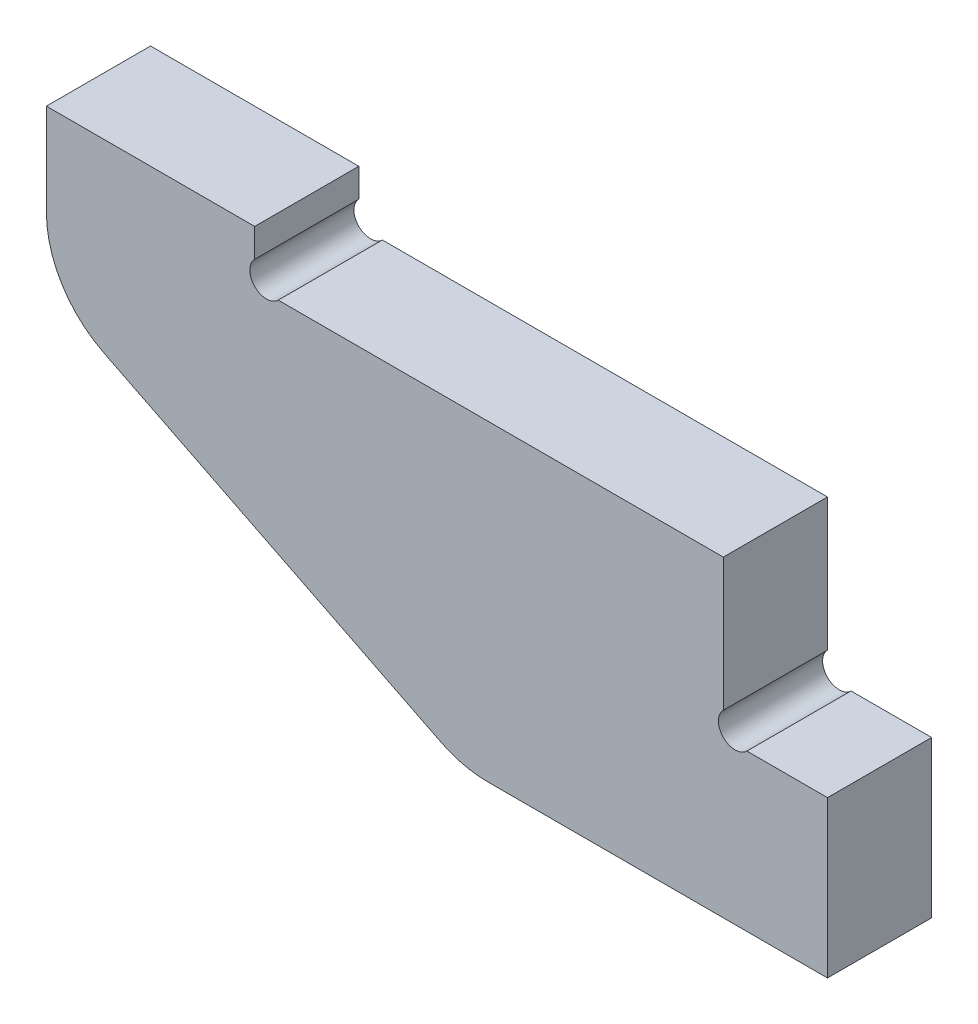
ISO-10303-21;
HEADER;
FILE_DESCRIPTION(('STEP AP214'),'2;1');
FILE_NAME('part.step','',(''),(''),'','','');
FILE_SCHEMA(('AUTOMOTIVE_DESIGN { 1 0 10303 214 1 1 1 1 }'));
ENDSEC;
DATA;
#1=APPLICATION_CONTEXT('core data for automotive mechanical design processes');
#2=APPLICATION_PROTOCOL_DEFINITION('international standard','automotive_design',2000,#1);
#3=PRODUCT_CONTEXT('',#1,'mechanical');
#4=PRODUCT('Part','Part','',(#3));
#5=PRODUCT_RELATED_PRODUCT_CATEGORY('part','',(#4));
#6=PRODUCT_DEFINITION_FORMATION('','',#4);
#7=PRODUCT_DEFINITION_CONTEXT('part definition',#1,'design');
#8=PRODUCT_DEFINITION('design','',#6,#7);
#9=PRODUCT_DEFINITION_SHAPE('','',#8);
#10=(LENGTH_UNIT() NAMED_UNIT(*) SI_UNIT(.MILLI.,.METRE.));
#11=(NAMED_UNIT(*) PLANE_ANGLE_UNIT() SI_UNIT($,.RADIAN.));
#12=(NAMED_UNIT(*) SI_UNIT($,.STERADIAN.) SOLID_ANGLE_UNIT());
#13=UNCERTAINTY_MEASURE_WITH_UNIT(LENGTH_MEASURE(1.E-05),#10,'distance_accuracy_value','');
#14=(GEOMETRIC_REPRESENTATION_CONTEXT(3) GLOBAL_UNCERTAINTY_ASSIGNED_CONTEXT((#13)) GLOBAL_UNIT_ASSIGNED_CONTEXT((#10,
#11,#12)) REPRESENTATION_CONTEXT('',''));
#15=CARTESIAN_POINT('',(0.,0.,0.));
#16=DIRECTION('',(0.,0.,1.));
#17=DIRECTION('',(1.,0.,0.));
#18=AXIS2_PLACEMENT_3D('',#15,#16,#17);
#19=CARTESIAN_POINT('',(-8.86862915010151,16.1313708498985,10.));
#20=DIRECTION('',(0.,0.,-1.));
#21=DIRECTION('',(-1.,0.,0.));
#22=AXIS2_PLACEMENT_3D('',#19,#20,#21);
#23=CYLINDRICAL_SURFACE('',#22,1.60000000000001);
#24=CARTESIAN_POINT('',(-8.86862915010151,16.1313708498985,0.));
#25=DIRECTION('',(0.,0.,-1.));
#26=DIRECTION('',(1.,0.,0.));
#27=AXIS2_PLACEMENT_3D('',#24,#25,#26);
#28=CIRCLE('',#27,1.60000000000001);
#29=CARTESIAN_POINT('',(-7.73725830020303,15.,0.));
#30=VERTEX_POINT('',#29);
#31=CARTESIAN_POINT('',(-10.,17.2627416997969,0.));
#32=VERTEX_POINT('',#31);
#33=EDGE_CURVE('E153',#30,#32,#28,.T.);
#34=ORIENTED_EDGE('',*,*,#33,.T.);
#35=DIRECTION('',(0.,0.,-1.));
#36=VECTOR('',#35,1.);
#37=CARTESIAN_POINT('',(-10.,17.2627416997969,10.));
#38=LINE('',#37,#36);
#39=CARTESIAN_POINT('',(-10.,17.2627416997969,10.));
#40=VERTEX_POINT('',#39);
#41=EDGE_CURVE('E135',#40,#32,#38,.T.);
#42=ORIENTED_EDGE('',*,*,#41,.F.);
#43=CARTESIAN_POINT('',(-8.86862915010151,16.1313708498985,10.));
#44=DIRECTION('',(0.,0.,-1.));
#45=DIRECTION('',(1.,0.,0.));
#46=AXIS2_PLACEMENT_3D('',#43,#44,#45);
#47=CIRCLE('',#46,1.60000000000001);
#48=CARTESIAN_POINT('',(-7.73725830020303,15.,10.));
#49=VERTEX_POINT('',#48);
#50=EDGE_CURVE('E141',#49,#40,#47,.T.);
#51=ORIENTED_EDGE('',*,*,#50,.F.);
#52=DIRECTION('',(0.,0.,-1.));
#53=VECTOR('',#52,1.);
#54=CARTESIAN_POINT('',(-7.73725830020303,15.,10.));
#55=LINE('',#54,#53);
#56=EDGE_CURVE('E205',#49,#30,#55,.T.);
#57=ORIENTED_EDGE('',*,*,#56,.T.);
#58=EDGE_LOOP('',(#34,#42,#51,#57));
#59=FACE_BOUND('',#58,.T.);
#60=ADVANCED_FACE('F33',(#59),#23,.F.);
#61=CARTESIAN_POINT('',(-10.,30.,10.));
#62=DIRECTION('',(-1.,0.,0.));
#63=DIRECTION('',(0.,-1.,0.));
#64=AXIS2_PLACEMENT_3D('',#61,#62,#63);
#65=PLANE('',#64);
#66=DIRECTION('',(0.,1.,0.));
#67=VECTOR('',#66,1.);
#68=CARTESIAN_POINT('',(-10.,30.,0.));
#69=LINE('',#68,#67);
#70=CARTESIAN_POINT('',(-10.,30.,0.));
#71=VERTEX_POINT('',#70);
#72=EDGE_CURVE('E233',#32,#71,#69,.T.);
#73=ORIENTED_EDGE('',*,*,#72,.T.);
#74=DIRECTION('',(0.,0.,-1.));
#75=VECTOR('',#74,1.);
#76=CARTESIAN_POINT('',(-10.,30.,10.));
#77=LINE('',#76,#75);
#78=CARTESIAN_POINT('',(-10.,30.,10.));
#79=VERTEX_POINT('',#78);
#80=EDGE_CURVE('E138',#79,#71,#77,.T.);
#81=ORIENTED_EDGE('',*,*,#80,.F.);
#82=DIRECTION('',(0.,1.,0.));
#83=VECTOR('',#82,1.);
#84=CARTESIAN_POINT('',(-10.,30.,10.));
#85=LINE('',#84,#83);
#86=EDGE_CURVE('E131',#40,#79,#85,.T.);
#87=ORIENTED_EDGE('',*,*,#86,.F.);
#88=ORIENTED_EDGE('',*,*,#41,.T.);
#89=EDGE_LOOP('',(#73,#81,#87,#88));
#90=FACE_BOUND('',#89,.T.);
#91=ADVANCED_FACE('F133',(#90),#65,.F.);
#92=CARTESIAN_POINT('',(-52.737258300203,30.,10.));
#93=DIRECTION('',(0.,-1.,0.));
#94=DIRECTION('',(1.,0.,0.));
#95=AXIS2_PLACEMENT_3D('',#92,#93,#94);
#96=PLANE('',#95);
#97=DIRECTION('',(-1.,0.,0.));
#98=VECTOR('',#97,1.);
#99=CARTESIAN_POINT('',(-52.737258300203,30.,0.));
#100=LINE('',#99,#98);
#101=CARTESIAN_POINT('',(-52.737258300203,30.,0.));
#102=VERTEX_POINT('',#101);
#103=EDGE_CURVE('E231',#71,#102,#100,.T.);
#104=ORIENTED_EDGE('',*,*,#103,.T.);
#105=DIRECTION('',(0.,0.,-1.));
#106=VECTOR('',#105,1.);
#107=CARTESIAN_POINT('',(-52.737258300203,30.,10.));
#108=LINE('',#107,#106);
#109=CARTESIAN_POINT('',(-52.737258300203,30.,10.));
#110=VERTEX_POINT('',#109);
#111=EDGE_CURVE('E158',#110,#102,#108,.T.);
#112=ORIENTED_EDGE('',*,*,#111,.F.);
#113=DIRECTION('',(-1.,0.,0.));
#114=VECTOR('',#113,1.);
#115=CARTESIAN_POINT('',(-52.737258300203,30.,10.));
#116=LINE('',#115,#114);
#117=EDGE_CURVE('E140',#79,#110,#116,.T.);
#118=ORIENTED_EDGE('',*,*,#117,.F.);
#119=ORIENTED_EDGE('',*,*,#80,.T.);
#120=EDGE_LOOP('',(#104,#112,#118,#119));
#121=FACE_BOUND('',#120,.T.);
#122=ADVANCED_FACE('F248',(#121),#96,.F.);
#123=CARTESIAN_POINT('',(-53.8686291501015,31.1313708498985,10.));
#124=DIRECTION('',(0.,0.,-1.));
#125=DIRECTION('',(-1.,0.,0.));
#126=AXIS2_PLACEMENT_3D('',#123,#124,#125);
#127=CYLINDRICAL_SURFACE('',#126,1.6);
#128=CARTESIAN_POINT('',(-53.8686291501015,31.1313708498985,0.));
#129=DIRECTION('',(0.,0.,-1.));
#130=DIRECTION('',(1.,0.,0.));
#131=AXIS2_PLACEMENT_3D('',#128,#129,#130);
#132=CIRCLE('',#131,1.6);
#133=CARTESIAN_POINT('',(-55.,32.2627416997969,0.));
#134=VERTEX_POINT('',#133);
#135=EDGE_CURVE('E226',#102,#134,#132,.T.);
#136=ORIENTED_EDGE('',*,*,#135,.T.);
#137=DIRECTION('',(0.,0.,-1.));
#138=VECTOR('',#137,1.);
#139=CARTESIAN_POINT('',(-55.,32.2627416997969,10.));
#140=LINE('',#139,#138);
#141=CARTESIAN_POINT('',(-55.,32.2627416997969,10.));
#142=VERTEX_POINT('',#141);
#143=EDGE_CURVE('E217',#142,#134,#140,.T.);
#144=ORIENTED_EDGE('',*,*,#143,.F.);
#145=CARTESIAN_POINT('',(-53.8686291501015,31.1313708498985,10.));
#146=DIRECTION('',(0.,0.,-1.));
#147=DIRECTION('',(1.,0.,0.));
#148=AXIS2_PLACEMENT_3D('',#145,#146,#147);
#149=CIRCLE('',#148,1.6);
#150=EDGE_CURVE('E227',#110,#142,#149,.T.);
#151=ORIENTED_EDGE('',*,*,#150,.F.);
#152=ORIENTED_EDGE('',*,*,#111,.T.);
#153=EDGE_LOOP('',(#136,#144,#151,#152));
#154=FACE_BOUND('',#153,.T.);
#155=ADVANCED_FACE('F224',(#154),#127,.F.);
#156=CARTESIAN_POINT('',(-55.,32.2627416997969,10.));
#157=DIRECTION('',(-1.,0.,0.));
#158=DIRECTION('',(0.,-1.,0.));
#159=AXIS2_PLACEMENT_3D('',#156,#157,#158);
#160=PLANE('',#159);
#161=DIRECTION('',(0.,1.,0.));
#162=VECTOR('',#161,1.);
#163=CARTESIAN_POINT('',(-55.,32.2627416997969,0.));
#164=LINE('',#163,#162);
#165=CARTESIAN_POINT('',(-55.,35.,0.));
#166=VERTEX_POINT('',#165);
#167=EDGE_CURVE('E197',#134,#166,#164,.T.);
#168=ORIENTED_EDGE('',*,*,#167,.T.);
#169=DIRECTION('',(0.,0.,-1.));
#170=VECTOR('',#169,1.);
#171=CARTESIAN_POINT('',(-55.,35.,10.));
#172=LINE('',#171,#170);
#173=CARTESIAN_POINT('',(-55.,35.,10.));
#174=VERTEX_POINT('',#173);
#175=EDGE_CURVE('E214',#174,#166,#172,.T.);
#176=ORIENTED_EDGE('',*,*,#175,.F.);
#177=DIRECTION('',(0.,1.,0.));
#178=VECTOR('',#177,1.);
#179=CARTESIAN_POINT('',(-55.,32.2627416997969,10.));
#180=LINE('',#179,#178);
#181=EDGE_CURVE('E245',#142,#174,#180,.T.);
#182=ORIENTED_EDGE('',*,*,#181,.F.);
#183=ORIENTED_EDGE('',*,*,#143,.T.);
#184=EDGE_LOOP('',(#168,#176,#182,#183));
#185=FACE_BOUND('',#184,.T.);
#186=ADVANCED_FACE('F255',(#185),#160,.F.);
#187=CARTESIAN_POINT('',(-55.,35.,10.));
#188=DIRECTION('',(0.,-1.,0.));
#189=DIRECTION('',(1.,0.,0.));
#190=AXIS2_PLACEMENT_3D('',#187,#188,#189);
#191=PLANE('',#190);
#192=DIRECTION('',(-1.,0.,0.));
#193=VECTOR('',#192,1.);
#194=CARTESIAN_POINT('',(-55.,35.,0.));
#195=LINE('',#194,#193);
#196=CARTESIAN_POINT('',(-75.,35.,0.));
#197=VERTEX_POINT('',#196);
#198=EDGE_CURVE('E193',#166,#197,#195,.T.);
#199=ORIENTED_EDGE('',*,*,#198,.T.);
#200=DIRECTION('',(0.,0.,-1.));
#201=VECTOR('',#200,1.);
#202=CARTESIAN_POINT('',(-75.,35.,10.));
#203=LINE('',#202,#201);
#204=CARTESIAN_POINT('',(-75.,35.,10.));
#205=VERTEX_POINT('',#204);
#206=EDGE_CURVE('E192',#205,#197,#203,.T.);
#207=ORIENTED_EDGE('',*,*,#206,.F.);
#208=DIRECTION('',(-1.,0.,0.));
#209=VECTOR('',#208,1.);
#210=CARTESIAN_POINT('',(-55.,35.,10.));
#211=LINE('',#210,#209);
#212=EDGE_CURVE('E243',#174,#205,#211,.T.);
#213=ORIENTED_EDGE('',*,*,#212,.F.);
#214=ORIENTED_EDGE('',*,*,#175,.T.);
#215=EDGE_LOOP('',(#199,#207,#213,#214));
#216=FACE_BOUND('',#215,.T.);
#217=ADVANCED_FACE('F290',(#216),#191,.F.);
#218=CARTESIAN_POINT('',(-75.,35.,10.));
#219=DIRECTION('',(1.,0.,0.));
#220=DIRECTION('',(0.,0.,-1.));
#221=AXIS2_PLACEMENT_3D('',#218,#219,#220);
#222=PLANE('',#221);
#223=DIRECTION('',(0.,-1.,0.));
#224=VECTOR('',#223,1.);
#225=CARTESIAN_POINT('',(-75.,35.,0.));
#226=LINE('',#225,#224);
#227=CARTESIAN_POINT('',(-75.,26.1803398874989,0.));
#228=VERTEX_POINT('',#227);
#229=EDGE_CURVE('E187',#197,#228,#226,.T.);
#230=ORIENTED_EDGE('',*,*,#229,.T.);
#231=DIRECTION('',(0.,0.,-1.));
#232=VECTOR('',#231,1.);
#233=CARTESIAN_POINT('',(-75.,26.1803398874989,10.));
#234=LINE('',#233,#232);
#235=CARTESIAN_POINT('',(-75.,26.1803398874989,10.));
#236=VERTEX_POINT('',#235);
#237=EDGE_CURVE('E56',#228,#236,#234,.F.);
#238=ORIENTED_EDGE('',*,*,#237,.T.);
#239=DIRECTION('',(0.,-1.,0.));
#240=VECTOR('',#239,1.);
#241=CARTESIAN_POINT('',(-75.,35.,10.));
#242=LINE('',#241,#240);
#243=EDGE_CURVE('E172',#205,#236,#242,.T.);
#244=ORIENTED_EDGE('',*,*,#243,.F.);
#245=ORIENTED_EDGE('',*,*,#206,.T.);
#246=EDGE_LOOP('',(#230,#238,#244,#245));
#247=FACE_BOUND('',#246,.T.);
#248=ADVANCED_FACE('F190',(#247),#222,.F.);
#249=CARTESIAN_POINT('',(-75.,20.,10.));
#250=DIRECTION('',(0.447213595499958,0.894427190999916,0.));
#251=DIRECTION('',(-0.894427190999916,0.447213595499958,0.));
#252=AXIS2_PLACEMENT_3D('',#249,#250,#251);
#253=PLANE('',#252);
#254=DIRECTION('',(0.894427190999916,-0.447213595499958,0.));
#255=VECTOR('',#254,1.);
#256=CARTESIAN_POINT('',(-75.,20.,10.));
#257=LINE('',#256,#255);
#258=CARTESIAN_POINT('',(-69.4721359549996,17.2360679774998,10.));
#259=VERTEX_POINT('',#258);
#260=CARTESIAN_POINT('',(-37.1114561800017,1.05572809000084,10.));
#261=VERTEX_POINT('',#260);
#262=EDGE_CURVE('E171',#259,#261,#257,.T.);
#263=ORIENTED_EDGE('',*,*,#262,.F.);
#264=DIRECTION('',(0.,0.,-1.));
#265=VECTOR('',#264,1.);
#266=CARTESIAN_POINT('',(-69.4721359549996,17.2360679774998,10.));
#267=LINE('',#266,#265);
#268=CARTESIAN_POINT('',(-69.4721359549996,17.2360679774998,0.));
#269=VERTEX_POINT('',#268);
#270=EDGE_CURVE('E156',#259,#269,#267,.T.);
#271=ORIENTED_EDGE('',*,*,#270,.T.);
#272=DIRECTION('',(0.894427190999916,-0.447213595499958,0.));
#273=VECTOR('',#272,1.);
#274=CARTESIAN_POINT('',(-75.,20.,0.));
#275=LINE('',#274,#273);
#276=CARTESIAN_POINT('',(-37.1114561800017,1.05572809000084,0.));
#277=VERTEX_POINT('',#276);
#278=EDGE_CURVE('E188',#269,#277,#275,.T.);
#279=ORIENTED_EDGE('',*,*,#278,.T.);
#280=DIRECTION('',(0.,0.,-1.));
#281=VECTOR('',#280,1.);
#282=CARTESIAN_POINT('',(-37.1114561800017,1.05572809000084,10.));
#283=LINE('',#282,#281);
#284=EDGE_CURVE('E154',#277,#261,#283,.F.);
#285=ORIENTED_EDGE('',*,*,#284,.T.);
#286=EDGE_LOOP('',(#263,#271,#279,#285));
#287=FACE_BOUND('',#286,.T.);
#288=ADVANCED_FACE('F176',(#287),#253,.F.);
#289=CARTESIAN_POINT('',(-35.,0.,10.));
#290=DIRECTION('',(0.,1.,0.));
#291=DIRECTION('',(0.,0.,1.));
#292=AXIS2_PLACEMENT_3D('',#289,#290,#291);
#293=PLANE('',#292);
#294=DIRECTION('',(1.,0.,0.));
#295=VECTOR('',#294,1.);
#296=CARTESIAN_POINT('',(-35.,0.,10.));
#297=LINE('',#296,#295);
#298=CARTESIAN_POINT('',(-32.6393202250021,0.,10.));
#299=VERTEX_POINT('',#298);
#300=CARTESIAN_POINT('',(0.,0.,10.));
#301=VERTEX_POINT('',#300);
#302=EDGE_CURVE('E180',#299,#301,#297,.T.);
#303=ORIENTED_EDGE('',*,*,#302,.F.);
#304=DIRECTION('',(0.,0.,-1.));
#305=VECTOR('',#304,1.);
#306=CARTESIAN_POINT('',(-32.6393202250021,0.,10.));
#307=LINE('',#306,#305);
#308=CARTESIAN_POINT('',(-32.6393202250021,0.,0.));
#309=VERTEX_POINT('',#308);
#310=EDGE_CURVE('E11',#299,#309,#307,.T.);
#311=ORIENTED_EDGE('',*,*,#310,.T.);
#312=DIRECTION('',(1.,0.,0.));
#313=VECTOR('',#312,1.);
#314=CARTESIAN_POINT('',(-35.,0.,0.));
#315=LINE('',#314,#313);
#316=CARTESIAN_POINT('',(0.,0.,0.));
#317=VERTEX_POINT('',#316);
#318=EDGE_CURVE('E195',#309,#317,#315,.T.);
#319=ORIENTED_EDGE('',*,*,#318,.T.);
#320=DIRECTION('',(0.,0.,-1.));
#321=VECTOR('',#320,1.);
#322=CARTESIAN_POINT('',(0.,0.,10.));
#323=LINE('',#322,#321);
#324=EDGE_CURVE('E210',#301,#317,#323,.T.);
#325=ORIENTED_EDGE('',*,*,#324,.F.);
#326=EDGE_LOOP('',(#303,#311,#319,#325));
#327=FACE_BOUND('',#326,.T.);
#328=ADVANCED_FACE('F281',(#327),#293,.F.);
#329=CARTESIAN_POINT('',(0.,0.,10.));
#330=DIRECTION('',(-1.,0.,0.));
#331=DIRECTION('',(0.,0.,1.));
#332=AXIS2_PLACEMENT_3D('',#329,#330,#331);
#333=PLANE('',#332);
#334=DIRECTION('',(0.,1.,0.));
#335=VECTOR('',#334,1.);
#336=CARTESIAN_POINT('',(0.,0.,0.));
#337=LINE('',#336,#335);
#338=CARTESIAN_POINT('',(0.,15.,0.));
#339=VERTEX_POINT('',#338);
#340=EDGE_CURVE('E202',#317,#339,#337,.T.);
#341=ORIENTED_EDGE('',*,*,#340,.T.);
#342=DIRECTION('',(0.,0.,-1.));
#343=VECTOR('',#342,1.);
#344=CARTESIAN_POINT('',(0.,15.,10.));
#345=LINE('',#344,#343);
#346=CARTESIAN_POINT('',(0.,15.,10.));
#347=VERTEX_POINT('',#346);
#348=EDGE_CURVE('E207',#347,#339,#345,.T.);
#349=ORIENTED_EDGE('',*,*,#348,.F.);
#350=DIRECTION('',(0.,1.,0.));
#351=VECTOR('',#350,1.);
#352=CARTESIAN_POINT('',(0.,0.,10.));
#353=LINE('',#352,#351);
#354=EDGE_CURVE('E239',#301,#347,#353,.T.);
#355=ORIENTED_EDGE('',*,*,#354,.F.);
#356=ORIENTED_EDGE('',*,*,#324,.T.);
#357=EDGE_LOOP('',(#341,#349,#355,#356));
#358=FACE_BOUND('',#357,.T.);
#359=ADVANCED_FACE('F277',(#358),#333,.F.);
#360=CARTESIAN_POINT('',(0.,15.,10.));
#361=DIRECTION('',(0.,-1.,0.));
#362=DIRECTION('',(0.,0.,-1.));
#363=AXIS2_PLACEMENT_3D('',#360,#361,#362);
#364=PLANE('',#363);
#365=DIRECTION('',(-1.,0.,0.));
#366=VECTOR('',#365,1.);
#367=CARTESIAN_POINT('',(0.,15.,0.));
#368=LINE('',#367,#366);
#369=EDGE_CURVE('E150',#339,#30,#368,.T.);
#370=ORIENTED_EDGE('',*,*,#369,.T.);
#371=ORIENTED_EDGE('',*,*,#56,.F.);
#372=DIRECTION('',(-1.,0.,0.));
#373=VECTOR('',#372,1.);
#374=CARTESIAN_POINT('',(0.,15.,10.));
#375=LINE('',#374,#373);
#376=EDGE_CURVE('E146',#347,#49,#375,.T.);
#377=ORIENTED_EDGE('',*,*,#376,.F.);
#378=ORIENTED_EDGE('',*,*,#348,.T.);
#379=EDGE_LOOP('',(#370,#371,#377,#378));
#380=FACE_BOUND('',#379,.T.);
#381=ADVANCED_FACE('F272',(#380),#364,.F.);
#382=CARTESIAN_POINT('',(-8.86862915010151,16.1313708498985,10.));
#383=DIRECTION('',(0.,0.,1.));
#384=DIRECTION('',(1.,0.,0.));
#385=AXIS2_PLACEMENT_3D('',#382,#383,#384);
#386=PLANE('',#385);
#387=ORIENTED_EDGE('',*,*,#243,.T.);
#388=CARTESIAN_POINT('',(-65.,26.1803398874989,10.));
#389=DIRECTION('',(0.,0.,1.));
#390=DIRECTION('',(1.,0.,0.));
#391=AXIS2_PLACEMENT_3D('',#388,#389,#390);
#392=CIRCLE('',#391,10.);
#393=EDGE_CURVE('E41',#236,#259,#392,.T.);
#394=ORIENTED_EDGE('',*,*,#393,.T.);
#395=ORIENTED_EDGE('',*,*,#262,.T.);
#396=CARTESIAN_POINT('',(-32.6393202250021,10.,10.));
#397=DIRECTION('',(0.,0.,1.));
#398=DIRECTION('',(1.,0.,0.));
#399=AXIS2_PLACEMENT_3D('',#396,#397,#398);
#400=CIRCLE('',#399,10.);
#401=EDGE_CURVE('E48',#261,#299,#400,.T.);
#402=ORIENTED_EDGE('',*,*,#401,.T.);
#403=ORIENTED_EDGE('',*,*,#302,.T.);
#404=ORIENTED_EDGE('',*,*,#354,.T.);
#405=ORIENTED_EDGE('',*,*,#376,.T.);
#406=ORIENTED_EDGE('',*,*,#50,.T.);
#407=ORIENTED_EDGE('',*,*,#86,.T.);
#408=ORIENTED_EDGE('',*,*,#117,.T.);
#409=ORIENTED_EDGE('',*,*,#150,.T.);
#410=ORIENTED_EDGE('',*,*,#181,.T.);
#411=ORIENTED_EDGE('',*,*,#212,.T.);
#412=EDGE_LOOP('',(#387,#394,#395,#402,#403,#404,#405,#406,#407,#408,#409,#410,#411));
#413=FACE_BOUND('',#412,.T.);
#414=ADVANCED_FACE('F144',(#413),#386,.T.);
#415=CARTESIAN_POINT('',(-8.86862915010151,16.1313708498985,0.));
#416=DIRECTION('',(0.,0.,1.));
#417=DIRECTION('',(1.,0.,0.));
#418=AXIS2_PLACEMENT_3D('',#415,#416,#417);
#419=PLANE('',#418);
#420=ORIENTED_EDGE('',*,*,#278,.F.);
#421=CARTESIAN_POINT('',(-65.,26.1803398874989,0.));
#422=DIRECTION('',(0.,0.,1.));
#423=DIRECTION('',(1.,0.,0.));
#424=AXIS2_PLACEMENT_3D('',#421,#422,#423);
#425=CIRCLE('',#424,10.);
#426=EDGE_CURVE('E166',#269,#228,#425,.F.);
#427=ORIENTED_EDGE('',*,*,#426,.T.);
#428=ORIENTED_EDGE('',*,*,#229,.F.);
#429=ORIENTED_EDGE('',*,*,#198,.F.);
#430=ORIENTED_EDGE('',*,*,#167,.F.);
#431=ORIENTED_EDGE('',*,*,#135,.F.);
#432=ORIENTED_EDGE('',*,*,#103,.F.);
#433=ORIENTED_EDGE('',*,*,#72,.F.);
#434=ORIENTED_EDGE('',*,*,#33,.F.);
#435=ORIENTED_EDGE('',*,*,#369,.F.);
#436=ORIENTED_EDGE('',*,*,#340,.F.);
#437=ORIENTED_EDGE('',*,*,#318,.F.);
#438=CARTESIAN_POINT('',(-32.6393202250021,10.,0.));
#439=DIRECTION('',(0.,0.,1.));
#440=DIRECTION('',(1.,0.,0.));
#441=AXIS2_PLACEMENT_3D('',#438,#439,#440);
#442=CIRCLE('',#441,10.);
#443=EDGE_CURVE('E164',#309,#277,#442,.F.);
#444=ORIENTED_EDGE('',*,*,#443,.T.);
#445=EDGE_LOOP('',(#420,#427,#428,#429,#430,#431,#432,#433,#434,#435,#436,#437,#444));
#446=FACE_BOUND('',#445,.T.);
#447=ADVANCED_FACE('F185',(#446),#419,.F.);
#448=CARTESIAN_POINT('',(-65.,26.1803398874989,10.));
#449=DIRECTION('',(0.,0.,-1.));
#450=DIRECTION('',(-1.,0.,0.));
#451=AXIS2_PLACEMENT_3D('',#448,#449,#450);
#452=CYLINDRICAL_SURFACE('',#451,10.);
#453=ORIENTED_EDGE('',*,*,#393,.F.);
#454=ORIENTED_EDGE('',*,*,#237,.F.);
#455=ORIENTED_EDGE('',*,*,#426,.F.);
#456=ORIENTED_EDGE('',*,*,#270,.F.);
#457=EDGE_LOOP('',(#453,#454,#455,#456));
#458=FACE_BOUND('',#457,.T.);
#459=ADVANCED_FACE('F182',(#458),#452,.T.);
#460=CARTESIAN_POINT('',(-32.6393202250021,10.,10.));
#461=DIRECTION('',(0.,0.,-1.));
#462=DIRECTION('',(-1.,0.,0.));
#463=AXIS2_PLACEMENT_3D('',#460,#461,#462);
#464=CYLINDRICAL_SURFACE('',#463,10.);
#465=ORIENTED_EDGE('',*,*,#401,.F.);
#466=ORIENTED_EDGE('',*,*,#284,.F.);
#467=ORIENTED_EDGE('',*,*,#443,.F.);
#468=ORIENTED_EDGE('',*,*,#310,.F.);
#469=EDGE_LOOP('',(#465,#466,#467,#468));
#470=FACE_BOUND('',#469,.T.);
#471=ADVANCED_FACE('F35',(#470),#464,.T.);
#472=CLOSED_SHELL('',(#60,#91,#122,#155,#186,#217,#248,#288,#328,#359,#381,#414,#447,#459,#471));
#473=MANIFOLD_SOLID_BREP('B2',#472);
#474=ADVANCED_BREP_SHAPE_REPRESENTATION('',(#18,#473),#14);
#475=SHAPE_DEFINITION_REPRESENTATION(#9,#474);
ENDSEC;
END-ISO-10303-21;
